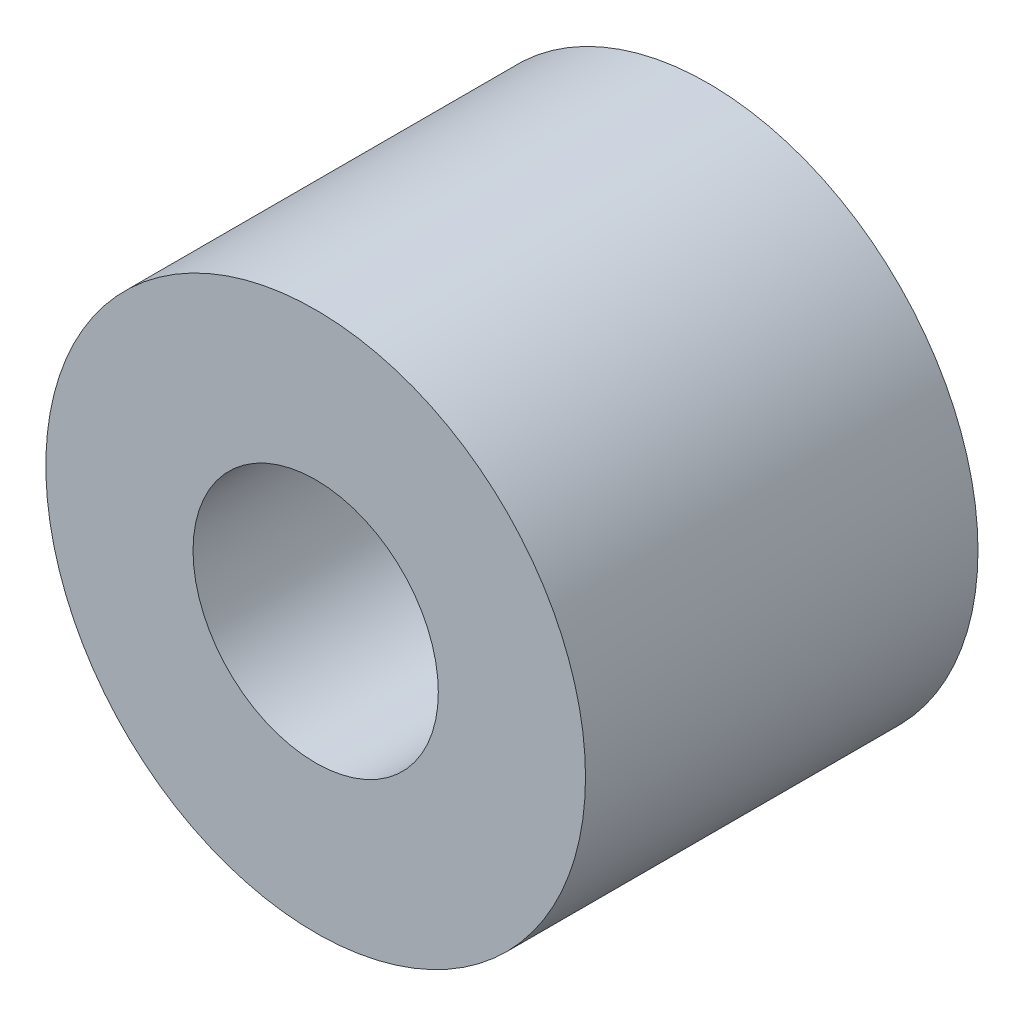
from build123d import *

# Parameters (mm, degrees)
ESQUISSE1_R      = 55
ESQUISSE1_R_2    = 25
EXTRUSION1_DEPTH = 80


with BuildPart() as part:
    # Esquisse1 → Extrusion1 (new body)
    with BuildSketch(Plane.XY):
        Circle(ESQUISSE1_R)
        Circle(ESQUISSE1_R_2, mode=Mode.SUBTRACT)
    extrude(amount=EXTRUSION1_DEPTH)


solid = part.part
